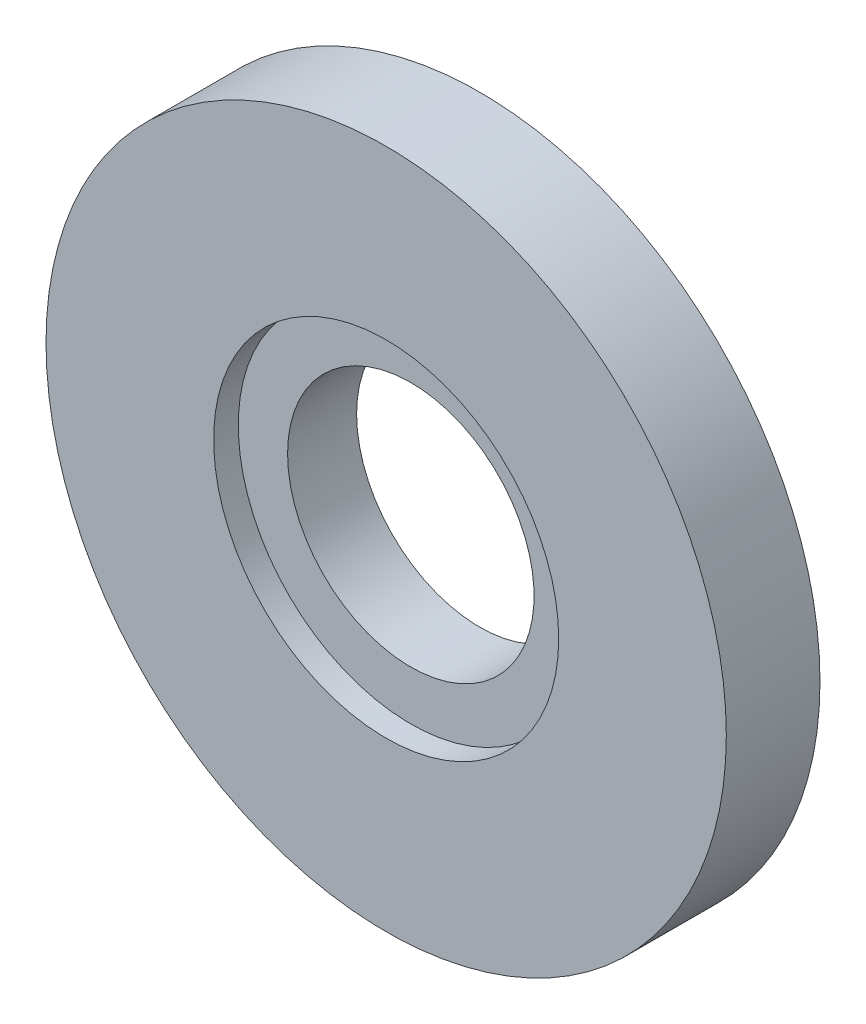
ISO-10303-21;
HEADER;
FILE_DESCRIPTION(('STEP AP214'),'2;1');
FILE_NAME('part.step','',(''),(''),'','','');
FILE_SCHEMA(('AUTOMOTIVE_DESIGN { 1 0 10303 214 1 1 1 1 }'));
ENDSEC;
DATA;
#1=APPLICATION_CONTEXT('core data for automotive mechanical design processes');
#2=APPLICATION_PROTOCOL_DEFINITION('international standard','automotive_design',2000,#1);
#3=PRODUCT_CONTEXT('',#1,'mechanical');
#4=PRODUCT('Part','Part','',(#3));
#5=PRODUCT_RELATED_PRODUCT_CATEGORY('part','',(#4));
#6=PRODUCT_DEFINITION_FORMATION('','',#4);
#7=PRODUCT_DEFINITION_CONTEXT('part definition',#1,'design');
#8=PRODUCT_DEFINITION('design','',#6,#7);
#9=PRODUCT_DEFINITION_SHAPE('','',#8);
#10=(LENGTH_UNIT() NAMED_UNIT(*) SI_UNIT(.MILLI.,.METRE.));
#11=(NAMED_UNIT(*) PLANE_ANGLE_UNIT() SI_UNIT($,.RADIAN.));
#12=(NAMED_UNIT(*) SI_UNIT($,.STERADIAN.) SOLID_ANGLE_UNIT());
#13=UNCERTAINTY_MEASURE_WITH_UNIT(LENGTH_MEASURE(1.E-05),#10,'distance_accuracy_value','');
#14=(GEOMETRIC_REPRESENTATION_CONTEXT(3) GLOBAL_UNCERTAINTY_ASSIGNED_CONTEXT((#13)) GLOBAL_UNIT_ASSIGNED_CONTEXT((#10,
#11,#12)) REPRESENTATION_CONTEXT('',''));
#15=CARTESIAN_POINT('',(0.,0.,0.));
#16=DIRECTION('',(0.,0.,1.));
#17=DIRECTION('',(1.,0.,0.));
#18=AXIS2_PLACEMENT_3D('',#15,#16,#17);
#19=CARTESIAN_POINT('',(0.,0.,2.413));
#20=DIRECTION('',(0.,0.,-0.999999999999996));
#21=DIRECTION('',(-0.999999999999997,0.,0.));
#22=AXIS2_PLACEMENT_3D('',#19,#20,#21);
#23=CYLINDRICAL_SURFACE('',#22,3.175);
#24=CARTESIAN_POINT('',(0.,0.,2.2291196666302E-13));
#25=DIRECTION('',(0.,0.,0.999999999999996));
#26=DIRECTION('',(0.999999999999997,0.,0.));
#27=AXIS2_PLACEMENT_3D('',#24,#25,#26);
#28=CIRCLE('',#27,3.175);
#29=CARTESIAN_POINT('',(-3.175,0.,2.22478285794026E-13));
#30=VERTEX_POINT('',#29);
#31=EDGE_CURVE('E44',#30,#30,#28,.T.);
#32=CARTESIAN_POINT('',(0.,0.,1.778));
#33=DIRECTION('',(0.,0.,0.999999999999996));
#34=DIRECTION('',(0.999999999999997,0.,0.));
#35=AXIS2_PLACEMENT_3D('',#32,#33,#34);
#36=CIRCLE('',#35,3.175);
#37=CARTESIAN_POINT('',(-3.175,0.,1.778));
#38=VERTEX_POINT('',#37);
#39=EDGE_CURVE('E36',#38,#38,#36,.T.);
#40=CARTESIAN_POINT('',(-3.175,0.,2.22478285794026E-13));
#41=CARTESIAN_POINT('',(-3.175,0.,0.0185208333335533));
#42=CARTESIAN_POINT('',(-3.175,0.,0.0370416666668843));
#43=CARTESIAN_POINT('',(-3.175,0.,0.0740833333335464));
#44=CARTESIAN_POINT('',(-3.175,0.,0.0926041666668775));
#45=CARTESIAN_POINT('',(-3.175,0.,0.12964583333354));
#46=CARTESIAN_POINT('',(-3.175,0.,0.148166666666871));
#47=CARTESIAN_POINT('',(-3.175,0.,0.185208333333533));
#48=CARTESIAN_POINT('',(-3.175,0.,0.203729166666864));
#49=CARTESIAN_POINT('',(-3.175,0.,0.240770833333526));
#50=CARTESIAN_POINT('',(-3.175,0.,0.259291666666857));
#51=CARTESIAN_POINT('',(-3.175,0.,0.296333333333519));
#52=CARTESIAN_POINT('',(-3.175,0.,0.31485416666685));
#53=CARTESIAN_POINT('',(-3.175,0.,0.351895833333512));
#54=CARTESIAN_POINT('',(-3.175,0.,0.370416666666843));
#55=CARTESIAN_POINT('',(-3.175,0.,0.407458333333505));
#56=CARTESIAN_POINT('',(-3.175,0.,0.425979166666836));
#57=CARTESIAN_POINT('',(-3.175,0.,0.463020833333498));
#58=CARTESIAN_POINT('',(-3.175,0.,0.481541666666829));
#59=CARTESIAN_POINT('',(-3.175,0.,0.518583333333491));
#60=CARTESIAN_POINT('',(-3.175,0.,0.537104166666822));
#61=CARTESIAN_POINT('',(-3.175,0.,0.574145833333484));
#62=CARTESIAN_POINT('',(-3.175,0.,0.592666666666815));
#63=CARTESIAN_POINT('',(-3.175,0.,0.629708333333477));
#64=CARTESIAN_POINT('',(-3.175,0.,0.648229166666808));
#65=CARTESIAN_POINT('',(-3.175,0.,0.68527083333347));
#66=CARTESIAN_POINT('',(-3.175,0.,0.703791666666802));
#67=CARTESIAN_POINT('',(-3.175,0.,0.740833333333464));
#68=CARTESIAN_POINT('',(-3.175,0.,0.759354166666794));
#69=CARTESIAN_POINT('',(-3.175,0.,0.796395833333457));
#70=CARTESIAN_POINT('',(-3.175,0.,0.814916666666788));
#71=CARTESIAN_POINT('',(-3.175,0.,0.85195833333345));
#72=CARTESIAN_POINT('',(-3.175,0.,0.870479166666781));
#73=CARTESIAN_POINT('',(-3.175,0.,0.907520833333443));
#74=CARTESIAN_POINT('',(-3.175,0.,0.926041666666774));
#75=CARTESIAN_POINT('',(-3.175,0.,0.963083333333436));
#76=CARTESIAN_POINT('',(-3.175,0.,0.981604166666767));
#77=CARTESIAN_POINT('',(-3.175,0.,1.01864583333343));
#78=CARTESIAN_POINT('',(-3.175,0.,1.03716666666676));
#79=CARTESIAN_POINT('',(-3.175,0.,1.07420833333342));
#80=CARTESIAN_POINT('',(-3.175,0.,1.09272916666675));
#81=CARTESIAN_POINT('',(-3.175,0.,1.12977083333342));
#82=CARTESIAN_POINT('',(-3.175,0.,1.14829166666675));
#83=CARTESIAN_POINT('',(-3.175,0.,1.18533333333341));
#84=CARTESIAN_POINT('',(-3.175,0.,1.20385416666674));
#85=CARTESIAN_POINT('',(-3.175,0.,1.2408958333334));
#86=CARTESIAN_POINT('',(-3.175,0.,1.25941666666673));
#87=CARTESIAN_POINT('',(-3.175,0.,1.29645833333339));
#88=CARTESIAN_POINT('',(-3.175,0.,1.31497916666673));
#89=CARTESIAN_POINT('',(-3.175,0.,1.35202083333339));
#90=CARTESIAN_POINT('',(-3.175,0.,1.37054166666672));
#91=CARTESIAN_POINT('',(-3.175,0.,1.40758333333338));
#92=CARTESIAN_POINT('',(-3.175,0.,1.42610416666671));
#93=CARTESIAN_POINT('',(-3.175,0.,1.46314583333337));
#94=CARTESIAN_POINT('',(-3.175,0.,1.4816666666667));
#95=CARTESIAN_POINT('',(-3.175,0.,1.51870833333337));
#96=CARTESIAN_POINT('',(-3.175,0.,1.5372291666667));
#97=CARTESIAN_POINT('',(-3.175,0.,1.57427083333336));
#98=CARTESIAN_POINT('',(-3.175,0.,1.59279166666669));
#99=CARTESIAN_POINT('',(-3.175,0.,1.62983333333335));
#100=CARTESIAN_POINT('',(-3.175,0.,1.64835416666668));
#101=CARTESIAN_POINT('',(-3.175,0.,1.68539583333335));
#102=CARTESIAN_POINT('',(-3.175,0.,1.70391666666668));
#103=CARTESIAN_POINT('',(-3.175,0.,1.74095833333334));
#104=CARTESIAN_POINT('',(-3.175,0.,1.75947916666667));
#105=CARTESIAN_POINT('',(-3.175,0.,1.778));
#106=B_SPLINE_CURVE_WITH_KNOTS('',3,(#40,#41,#42,#43,#44,#45,#46,#47,#48,#49,#50,#51,#52,#53,
#54,#55,#56,#57,#58,#59,#60,#61,#62,#63,#64,#65,#66,#67,#68,#69,#70,#71,#72,#73,#74,#75,#76,#77,
#78,#79,#80,#81,#82,#83,#84,#85,#86,#87,#88,#89,#90,#91,#92,#93,#94,#95,#96,#97,#98,#99,#100,
#101,#102,#103,#104,#105),.UNSPECIFIED.,.F.,.F.,(4,2,2,2,2,2,2,2,2,2,2,2,2,2,2,2,2,2,2,2,2,2,2,
2,2,2,2,2,2,2,2,2,4),(0.,0.0555624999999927,0.111124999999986,0.166687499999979,
0.222249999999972,0.277812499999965,0.333374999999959,0.388937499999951,0.444499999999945,
0.500062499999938,0.555624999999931,0.611187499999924,0.666749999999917,0.72231249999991,
0.777874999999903,0.833437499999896,0.888999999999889,0.944562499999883,1.00012499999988,
1.05568749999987,1.11124999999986,1.16681249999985,1.22237499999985,1.27793749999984,
1.33349999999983,1.38906249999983,1.44462499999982,1.50018749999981,1.55574999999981,
1.6113124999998,1.66687499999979,1.72243749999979,1.77799999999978),.UNSPECIFIED.);
#107=EDGE_CURVE('BSEAM32',#30,#38,#106,.T.);
#108=ORIENTED_EDGE('',*,*,#31,.F.);
#109=ORIENTED_EDGE('',*,*,#39,.T.);
#110=ORIENTED_EDGE('',*,*,#107,.T.);
#111=ORIENTED_EDGE('',*,*,#107,.F.);
#112=EDGE_LOOP('',(#108,#110,#109,#111));
#113=FACE_BOUND('',#112,.T.);
#114=ADVANCED_FACE('F32',(#113),#23,.F.);
#115=CARTESIAN_POINT('',(0.,0.,2.413));
#116=DIRECTION('',(0.,0.,0.999999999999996));
#117=DIRECTION('',(0.999999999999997,0.,0.));
#118=AXIS2_PLACEMENT_3D('',#115,#116,#117);
#119=PLANE('',#118);
#120=CARTESIAN_POINT('',(0.,0.,2.413));
#121=DIRECTION('',(0.,0.,0.999999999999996));
#122=DIRECTION('',(0.999999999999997,0.,0.));
#123=AXIS2_PLACEMENT_3D('',#120,#121,#122);
#124=CIRCLE('',#123,4.445);
#125=CARTESIAN_POINT('',(4.44499999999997,0.,2.413));
#126=VERTEX_POINT('',#125);
#127=EDGE_CURVE('E52',#126,#126,#124,.T.);
#128=ORIENTED_EDGE('',*,*,#127,.F.);
#129=EDGE_LOOP('',(#128));
#130=FACE_BOUND('',#129,.T.);
#131=CARTESIAN_POINT('',(0.,0.,2.413));
#132=DIRECTION('',(0.,0.,0.999999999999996));
#133=DIRECTION('',(0.999999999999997,0.,0.));
#134=AXIS2_PLACEMENT_3D('',#131,#132,#133);
#135=CIRCLE('',#134,8.763);
#136=CARTESIAN_POINT('',(-8.76299999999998,0.,2.413));
#137=VERTEX_POINT('',#136);
#138=EDGE_CURVE('E10',#137,#137,#135,.T.);
#139=ORIENTED_EDGE('',*,*,#138,.T.);
#140=EDGE_LOOP('',(#139));
#141=FACE_BOUND('',#140,.T.);
#142=ADVANCED_FACE('F58',(#130,#141),#119,.T.);
#143=CARTESIAN_POINT('',(0.,0.,2.2291196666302E-13));
#144=DIRECTION('',(0.,0.,0.999999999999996));
#145=DIRECTION('',(0.999999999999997,0.,0.));
#146=AXIS2_PLACEMENT_3D('',#143,#144,#145);
#147=PLANE('',#146);
#148=CARTESIAN_POINT('',(0.,0.,2.2291196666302E-13));
#149=DIRECTION('',(0.,0.,0.999999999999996));
#150=DIRECTION('',(0.999999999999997,0.,0.));
#151=AXIS2_PLACEMENT_3D('',#148,#149,#150);
#152=CIRCLE('',#151,8.763);
#153=CARTESIAN_POINT('',(-8.76299999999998,0.,2.21610924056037E-13));
#154=VERTEX_POINT('',#153);
#155=EDGE_CURVE('E40',#154,#154,#152,.T.);
#156=ORIENTED_EDGE('',*,*,#155,.F.);
#157=EDGE_LOOP('',(#156));
#158=FACE_BOUND('',#157,.T.);
#159=ORIENTED_EDGE('',*,*,#31,.T.);
#160=EDGE_LOOP('',(#159));
#161=FACE_BOUND('',#160,.T.);
#162=ADVANCED_FACE('F60',(#158,#161),#147,.F.);
#163=CARTESIAN_POINT('',(0.,0.,2.413));
#164=DIRECTION('',(0.,0.,-0.999999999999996));
#165=DIRECTION('',(-0.999999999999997,0.,0.));
#166=AXIS2_PLACEMENT_3D('',#163,#164,#165);
#167=CYLINDRICAL_SURFACE('',#166,8.763);
#168=CARTESIAN_POINT('',(-8.76299999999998,0.,2.413));
#169=CARTESIAN_POINT('',(-8.76299999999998,0.,2.38786458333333));
#170=CARTESIAN_POINT('',(-8.76299999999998,0.,2.36272916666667));
#171=CARTESIAN_POINT('',(-8.76299999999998,0.,2.31245833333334));
#172=CARTESIAN_POINT('',(-8.76299999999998,0.,2.28732291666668));
#173=CARTESIAN_POINT('',(-8.76299999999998,0.,2.23705208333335));
#174=CARTESIAN_POINT('',(-8.76299999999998,0.,2.21191666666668));
#175=CARTESIAN_POINT('',(-8.76299999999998,0.,2.16164583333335));
#176=CARTESIAN_POINT('',(-8.76299999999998,0.,2.13651041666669));
#177=CARTESIAN_POINT('',(-8.76299999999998,0.,2.08623958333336));
#178=CARTESIAN_POINT('',(-8.76299999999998,0.,2.0611041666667));
#179=CARTESIAN_POINT('',(-8.76299999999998,0.,2.01083333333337));
#180=CARTESIAN_POINT('',(-8.76299999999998,0.,1.9856979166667));
#181=CARTESIAN_POINT('',(-8.76299999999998,0.,1.93542708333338));
#182=CARTESIAN_POINT('',(-8.76299999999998,0.,1.91029166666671));
#183=CARTESIAN_POINT('',(-8.76299999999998,0.,1.86002083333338));
#184=CARTESIAN_POINT('',(-8.76299999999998,0.,1.83488541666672));
#185=CARTESIAN_POINT('',(-8.76299999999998,0.,1.78461458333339));
#186=CARTESIAN_POINT('',(-8.76299999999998,0.,1.75947916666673));
#187=CARTESIAN_POINT('',(-8.76299999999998,0.,1.7092083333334));
#188=CARTESIAN_POINT('',(-8.76299999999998,0.,1.68407291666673));
#189=CARTESIAN_POINT('',(-8.76299999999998,0.,1.6338020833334));
#190=CARTESIAN_POINT('',(-8.76299999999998,0.,1.60866666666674));
#191=CARTESIAN_POINT('',(-8.76299999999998,0.,1.55839583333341));
#192=CARTESIAN_POINT('',(-8.76299999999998,0.,1.53326041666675));
#193=CARTESIAN_POINT('',(-8.76299999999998,0.,1.48298958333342));
#194=CARTESIAN_POINT('',(-8.76299999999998,0.,1.45785416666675));
#195=CARTESIAN_POINT('',(-8.76299999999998,0.,1.40758333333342));
#196=CARTESIAN_POINT('',(-8.76299999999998,0.,1.38244791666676));
#197=CARTESIAN_POINT('',(-8.76299999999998,0.,1.33217708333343));
#198=CARTESIAN_POINT('',(-8.76299999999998,0.,1.30704166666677));
#199=CARTESIAN_POINT('',(-8.76299999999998,0.,1.25677083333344));
#200=CARTESIAN_POINT('',(-8.76299999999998,0.,1.23163541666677));
#201=CARTESIAN_POINT('',(-8.76299999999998,0.,1.18136458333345));
#202=CARTESIAN_POINT('',(-8.76299999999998,0.,1.15622916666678));
#203=CARTESIAN_POINT('',(-8.76299999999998,0.,1.10595833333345));
#204=CARTESIAN_POINT('',(-8.76299999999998,0.,1.08082291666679));
#205=CARTESIAN_POINT('',(-8.76299999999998,0.,1.03055208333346));
#206=CARTESIAN_POINT('',(-8.76299999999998,0.,1.00541666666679));
#207=CARTESIAN_POINT('',(-8.76299999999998,0.,0.955145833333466));
#208=CARTESIAN_POINT('',(-8.76299999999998,0.,0.930010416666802));
#209=CARTESIAN_POINT('',(-8.76299999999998,0.,0.879739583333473));
#210=CARTESIAN_POINT('',(-8.76299999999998,0.,0.854604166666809));
#211=CARTESIAN_POINT('',(-8.76299999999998,0.,0.80433333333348));
#212=CARTESIAN_POINT('',(-8.76299999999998,0.,0.779197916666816));
#213=CARTESIAN_POINT('',(-8.76299999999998,0.,0.728927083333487));
#214=CARTESIAN_POINT('',(-8.76299999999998,0.,0.703791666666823));
#215=CARTESIAN_POINT('',(-8.76299999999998,0.,0.653520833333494));
#216=CARTESIAN_POINT('',(-8.76299999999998,0.,0.62838541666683));
#217=CARTESIAN_POINT('',(-8.76299999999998,0.,0.578114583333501));
#218=CARTESIAN_POINT('',(-8.76299999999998,0.,0.552979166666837));
#219=CARTESIAN_POINT('',(-8.76299999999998,0.,0.502708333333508));
#220=CARTESIAN_POINT('',(-8.76299999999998,0.,0.477572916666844));
#221=CARTESIAN_POINT('',(-8.76299999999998,0.,0.427302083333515));
#222=CARTESIAN_POINT('',(-8.76299999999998,0.,0.402166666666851));
#223=CARTESIAN_POINT('',(-8.76299999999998,0.,0.351895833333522));
#224=CARTESIAN_POINT('',(-8.76299999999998,0.,0.326760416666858));
#225=CARTESIAN_POINT('',(-8.76299999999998,0.,0.276489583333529));
#226=CARTESIAN_POINT('',(-8.76299999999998,0.,0.251354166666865));
#227=CARTESIAN_POINT('',(-8.76299999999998,0.,0.201083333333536));
#228=CARTESIAN_POINT('',(-8.76299999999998,0.,0.175947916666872));
#229=CARTESIAN_POINT('',(-8.76299999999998,0.,0.125677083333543));
#230=CARTESIAN_POINT('',(-8.76299999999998,0.,0.100541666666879));
#231=CARTESIAN_POINT('',(-8.76299999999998,0.,0.0502708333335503));
#232=CARTESIAN_POINT('',(-8.76299999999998,0.,0.025135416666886));
#233=CARTESIAN_POINT('',(-8.76299999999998,0.,2.21610924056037E-13));
#234=B_SPLINE_CURVE_WITH_KNOTS('',3,(#168,#169,#170,#171,#172,#173,#174,#175,#176,#177,#178,
#179,#180,#181,#182,#183,#184,#185,#186,#187,#188,#189,#190,#191,#192,#193,#194,#195,#196,#197,
#198,#199,#200,#201,#202,#203,#204,#205,#206,#207,#208,#209,#210,#211,#212,#213,#214,#215,#216,
#217,#218,#219,#220,#221,#222,#223,#224,#225,#226,#227,#228,#229,#230,#231,#232,#233),
.UNSPECIFIED.,.F.,.F.,(4,2,2,2,2,2,2,2,2,2,2,2,2,2,2,2,2,2,2,2,2,2,2,2,2,2,2,2,2,2,2,2,4),(0.,
0.0754062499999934,0.150812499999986,0.226218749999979,0.301624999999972,0.377031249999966,
0.452437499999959,0.527843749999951,0.603249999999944,0.678656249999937,0.75406249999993,
0.829468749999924,0.904874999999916,0.980281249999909,1.0556874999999,1.1310937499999,
1.20649999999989,1.28190624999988,1.35731249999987,1.43271874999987,1.50812499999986,
1.58353124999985,1.65893749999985,1.73434374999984,1.80974999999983,1.88515624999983,
1.96056249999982,2.03596874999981,2.1113749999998,2.1867812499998,2.26218749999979,
2.33759374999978,2.41299999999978),.UNSPECIFIED.);
#235=EDGE_CURVE('BSEAM34',#137,#154,#234,.T.);
#236=ORIENTED_EDGE('',*,*,#138,.F.);
#237=ORIENTED_EDGE('',*,*,#155,.T.);
#238=ORIENTED_EDGE('',*,*,#235,.T.);
#239=ORIENTED_EDGE('',*,*,#235,.F.);
#240=EDGE_LOOP('',(#236,#238,#237,#239));
#241=FACE_BOUND('',#240,.T.);
#242=ADVANCED_FACE('F34',(#241),#167,.T.);
#243=CARTESIAN_POINT('',(0.,0.,1.778));
#244=DIRECTION('',(0.,0.,0.999999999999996));
#245=DIRECTION('',(0.999999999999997,0.,0.));
#246=AXIS2_PLACEMENT_3D('',#243,#244,#245);
#247=CYLINDRICAL_SURFACE('',#246,4.445);
#248=CARTESIAN_POINT('',(0.,0.,1.778));
#249=DIRECTION('',(0.,0.,0.999999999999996));
#250=DIRECTION('',(0.999999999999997,0.,0.));
#251=AXIS2_PLACEMENT_3D('',#248,#249,#250);
#252=CIRCLE('',#251,4.445);
#253=CARTESIAN_POINT('',(4.44499999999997,0.,1.778));
#254=VERTEX_POINT('',#253);
#255=EDGE_CURVE('E49',#254,#254,#252,.T.);
#256=CARTESIAN_POINT('',(4.44499999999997,0.,1.778));
#257=CARTESIAN_POINT('',(4.44499999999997,0.,1.78461458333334));
#258=CARTESIAN_POINT('',(4.44499999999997,0.,1.79122916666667));
#259=CARTESIAN_POINT('',(4.44499999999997,0.,1.80445833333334));
#260=CARTESIAN_POINT('',(4.44499999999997,0.,1.81107291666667));
#261=CARTESIAN_POINT('',(4.44499999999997,0.,1.82430208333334));
#262=CARTESIAN_POINT('',(4.44499999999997,0.,1.83091666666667));
#263=CARTESIAN_POINT('',(4.44499999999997,0.,1.84414583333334));
#264=CARTESIAN_POINT('',(4.44499999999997,0.,1.85076041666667));
#265=CARTESIAN_POINT('',(4.44499999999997,0.,1.86398958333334));
#266=CARTESIAN_POINT('',(4.44499999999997,0.,1.87060416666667));
#267=CARTESIAN_POINT('',(4.44499999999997,0.,1.88383333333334));
#268=CARTESIAN_POINT('',(4.44499999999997,0.,1.89044791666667));
#269=CARTESIAN_POINT('',(4.44499999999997,0.,1.90367708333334));
#270=CARTESIAN_POINT('',(4.44499999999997,0.,1.91029166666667));
#271=CARTESIAN_POINT('',(4.44499999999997,0.,1.92352083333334));
#272=CARTESIAN_POINT('',(4.44499999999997,0.,1.93013541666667));
#273=CARTESIAN_POINT('',(4.44499999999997,0.,1.94336458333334));
#274=CARTESIAN_POINT('',(4.44499999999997,0.,1.94997916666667));
#275=CARTESIAN_POINT('',(4.44499999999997,0.,1.96320833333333));
#276=CARTESIAN_POINT('',(4.44499999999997,0.,1.96982291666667));
#277=CARTESIAN_POINT('',(4.44499999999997,0.,1.98305208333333));
#278=CARTESIAN_POINT('',(4.44499999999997,0.,1.98966666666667));
#279=CARTESIAN_POINT('',(4.44499999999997,0.,2.00289583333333));
#280=CARTESIAN_POINT('',(4.44499999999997,0.,2.00951041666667));
#281=CARTESIAN_POINT('',(4.44499999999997,0.,2.02273958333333));
#282=CARTESIAN_POINT('',(4.44499999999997,0.,2.02935416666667));
#283=CARTESIAN_POINT('',(4.44499999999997,0.,2.04258333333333));
#284=CARTESIAN_POINT('',(4.44499999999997,0.,2.04919791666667));
#285=CARTESIAN_POINT('',(4.44499999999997,0.,2.06242708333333));
#286=CARTESIAN_POINT('',(4.44499999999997,0.,2.06904166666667));
#287=CARTESIAN_POINT('',(4.44499999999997,0.,2.08227083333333));
#288=CARTESIAN_POINT('',(4.44499999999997,0.,2.08888541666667));
#289=CARTESIAN_POINT('',(4.44499999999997,0.,2.10211458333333));
#290=CARTESIAN_POINT('',(4.44499999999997,0.,2.10872916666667));
#291=CARTESIAN_POINT('',(4.44499999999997,0.,2.12195833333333));
#292=CARTESIAN_POINT('',(4.44499999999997,0.,2.12857291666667));
#293=CARTESIAN_POINT('',(4.44499999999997,0.,2.14180208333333));
#294=CARTESIAN_POINT('',(4.44499999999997,0.,2.14841666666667));
#295=CARTESIAN_POINT('',(4.44499999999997,0.,2.16164583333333));
#296=CARTESIAN_POINT('',(4.44499999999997,0.,2.16826041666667));
#297=CARTESIAN_POINT('',(4.44499999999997,0.,2.18148958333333));
#298=CARTESIAN_POINT('',(4.44499999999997,0.,2.18810416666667));
#299=CARTESIAN_POINT('',(4.44499999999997,0.,2.20133333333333));
#300=CARTESIAN_POINT('',(4.44499999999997,0.,2.20794791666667));
#301=CARTESIAN_POINT('',(4.44499999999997,0.,2.22117708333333));
#302=CARTESIAN_POINT('',(4.44499999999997,0.,2.22779166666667));
#303=CARTESIAN_POINT('',(4.44499999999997,0.,2.24102083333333));
#304=CARTESIAN_POINT('',(4.44499999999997,0.,2.24763541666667));
#305=CARTESIAN_POINT('',(4.44499999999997,0.,2.26086458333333));
#306=CARTESIAN_POINT('',(4.44499999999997,0.,2.26747916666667));
#307=CARTESIAN_POINT('',(4.44499999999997,0.,2.28070833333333));
#308=CARTESIAN_POINT('',(4.44499999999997,0.,2.28732291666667));
#309=CARTESIAN_POINT('',(4.44499999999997,0.,2.30055208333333));
#310=CARTESIAN_POINT('',(4.44499999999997,0.,2.30716666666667));
#311=CARTESIAN_POINT('',(4.44499999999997,0.,2.32039583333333));
#312=CARTESIAN_POINT('',(4.44499999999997,0.,2.32701041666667));
#313=CARTESIAN_POINT('',(4.44499999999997,0.,2.34023958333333));
#314=CARTESIAN_POINT('',(4.44499999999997,0.,2.34685416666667));
#315=CARTESIAN_POINT('',(4.44499999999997,0.,2.36008333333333));
#316=CARTESIAN_POINT('',(4.44499999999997,0.,2.36669791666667));
#317=CARTESIAN_POINT('',(4.44499999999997,0.,2.37992708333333));
#318=CARTESIAN_POINT('',(4.44499999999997,0.,2.38654166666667));
#319=CARTESIAN_POINT('',(4.44499999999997,0.,2.39977083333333));
#320=CARTESIAN_POINT('',(4.44499999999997,0.,2.40638541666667));
#321=CARTESIAN_POINT('',(4.44499999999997,0.,2.413));
#322=B_SPLINE_CURVE_WITH_KNOTS('',3,(#256,#257,#258,#259,#260,#261,#262,#263,#264,#265,#266,
#267,#268,#269,#270,#271,#272,#273,#274,#275,#276,#277,#278,#279,#280,#281,#282,#283,#284,#285,
#286,#287,#288,#289,#290,#291,#292,#293,#294,#295,#296,#297,#298,#299,#300,#301,#302,#303,#304,
#305,#306,#307,#308,#309,#310,#311,#312,#313,#314,#315,#316,#317,#318,#319,#320,#321),
.UNSPECIFIED.,.F.,.F.,(4,2,2,2,2,2,2,2,2,2,2,2,2,2,2,2,2,2,2,2,2,2,2,2,2,2,2,2,2,2,2,2,4),(0.,
0.0198437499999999,0.0396874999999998,0.0595312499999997,0.0793749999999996,0.0992187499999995,
0.119062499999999,0.138906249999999,0.158749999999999,0.178593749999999,0.198437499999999,
0.218281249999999,0.238124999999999,0.257968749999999,0.277812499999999,0.297656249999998,
0.317499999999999,0.337343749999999,0.357187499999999,0.377031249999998,0.396874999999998,
0.416718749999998,0.436562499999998,0.456406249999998,0.476249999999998,0.496093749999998,
0.515937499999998,0.535781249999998,0.555624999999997,0.575468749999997,0.595312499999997,
0.615156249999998,0.634999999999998),.UNSPECIFIED.);
#323=EDGE_CURVE('BSEAM56',#254,#126,#322,.T.);
#324=ORIENTED_EDGE('',*,*,#255,.F.);
#325=ORIENTED_EDGE('',*,*,#127,.T.);
#326=ORIENTED_EDGE('',*,*,#323,.T.);
#327=ORIENTED_EDGE('',*,*,#323,.F.);
#328=EDGE_LOOP('',(#324,#326,#325,#327));
#329=FACE_BOUND('',#328,.T.);
#330=ADVANCED_FACE('F56',(#329),#247,.F.);
#331=CARTESIAN_POINT('',(0.,0.,1.778));
#332=DIRECTION('',(0.,0.,0.999999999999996));
#333=DIRECTION('',(0.999999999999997,0.,0.));
#334=AXIS2_PLACEMENT_3D('',#331,#332,#333);
#335=PLANE('',#334);
#336=ORIENTED_EDGE('',*,*,#39,.F.);
#337=EDGE_LOOP('',(#336));
#338=FACE_BOUND('',#337,.T.);
#339=ORIENTED_EDGE('',*,*,#255,.T.);
#340=EDGE_LOOP('',(#339));
#341=FACE_BOUND('',#340,.T.);
#342=ADVANCED_FACE('F72',(#338,#341),#335,.T.);
#343=CLOSED_SHELL('',(#114,#142,#162,#242,#330,#342));
#344=MANIFOLD_SOLID_BREP('B2',#343);
#345=ADVANCED_BREP_SHAPE_REPRESENTATION('',(#18,#344),#14);
#346=SHAPE_DEFINITION_REPRESENTATION(#9,#345);
ENDSEC;
END-ISO-10303-21;
